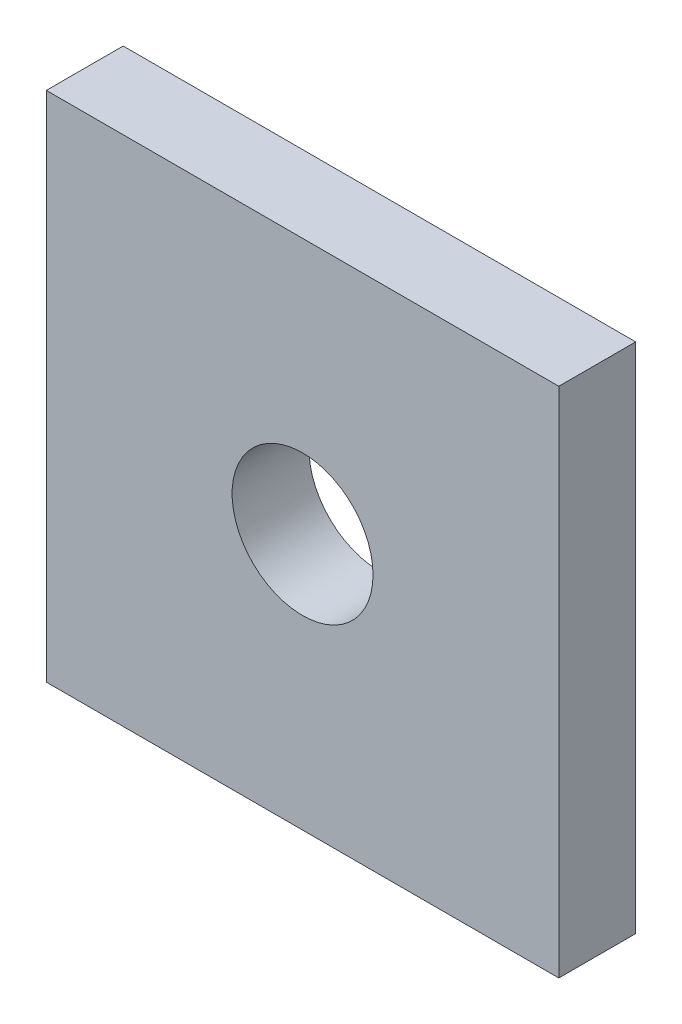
from build123d import *

# Parameters (mm, degrees)
SKETCH1_W      = 20
SKETCH1_H      = 20
SKETCH1_R      = 2.75
EXTRUDE1_DEPTH = 3


with BuildPart() as part:
    # Sketch1 → Extrude1 (new body)
    with BuildSketch(Plane.XY):
        with Locations((10, 10)):
            Rectangle(SKETCH1_W, SKETCH1_H)
        with Locations((10, 10)):
            Circle(SKETCH1_R, mode=Mode.SUBTRACT)
    extrude(amount=EXTRUDE1_DEPTH)


solid = part.part
